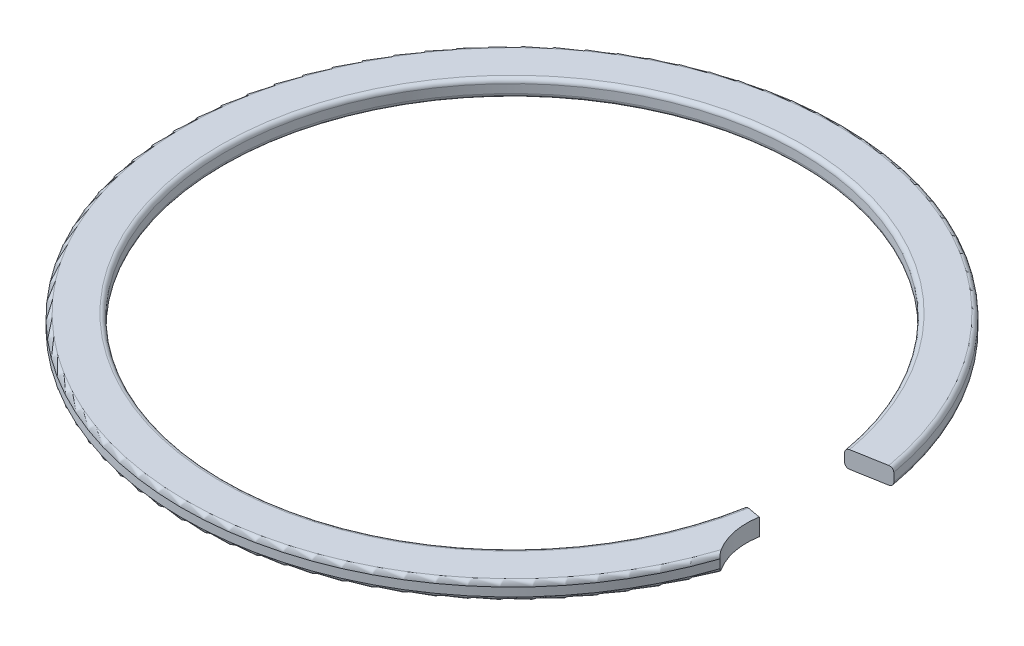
from build123d import *

# Parameters (mm, degrees)
EXTRUDE1_DEPTH      = 0.46
EXTRUDE1_DEPTH_BACK = 0.46


with BuildPart() as part:
    # Sketch1 → Revolve1 (revolve)
    with BuildSketch(Plane.XY, mode=Mode.PRIVATE) as revolve1_sk:
        with BuildLine():
            Line((7.72, 0.115), (7.72, -0.115))
            ThreePointArc((7.72, -0.115), (7.75368272, -0.19631728), (7.835, -0.23))
            Line((7.835, -0.23), (8.745, -0.23))
            ThreePointArc((8.745, -0.23), (8.82631728, -0.19631728), (8.86, -0.115))
            Line((8.86, -0.115), (8.86, 0.115))
            ThreePointArc((8.86, 0.115), (8.82631728, 0.19631728), (8.745, 0.23))
            Line((8.745, 0.23), (7.835, 0.23))
            ThreePointArc((7.835, 0.23), (7.75368272, 0.19631728), (7.72, 0.115))
        make_face()
    revolve(revolve1_sk.sketch.rotate(Axis((0, -0.46, 0), (0, 1, 0)), 270), axis=Axis((0, -0.46, 0), (0, 1, 0)))

    # Sketch2 → Extrude1 (cut, two sides: drawn at the far end of the back side and taken through both)
    with BuildSketch(Plane(origin=(0, 0, 0), x_dir=(-1, 0, 0), z_dir=(0, 1, 0)).offset(-EXTRUDE1_DEPTH_BACK)):
        with BuildLine():
            Line((0, 0), (-8.070499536, 1.423046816))
            ThreePointArc((-8.070499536, 1.423046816), (-8.259945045, 2.594304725), (-9.135594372, 3.394912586))
            ThreePointArc((-9.135594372, 3.394912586), (-9.705999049, 0.882098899), (-9.597936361, -1.69237514))
            Line((-9.597936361, -1.69237514), (0, 0))
        make_face()
    extrude(amount=EXTRUDE1_DEPTH + EXTRUDE1_DEPTH_BACK, mode=Mode.SUBTRACT)


solid = part.part
